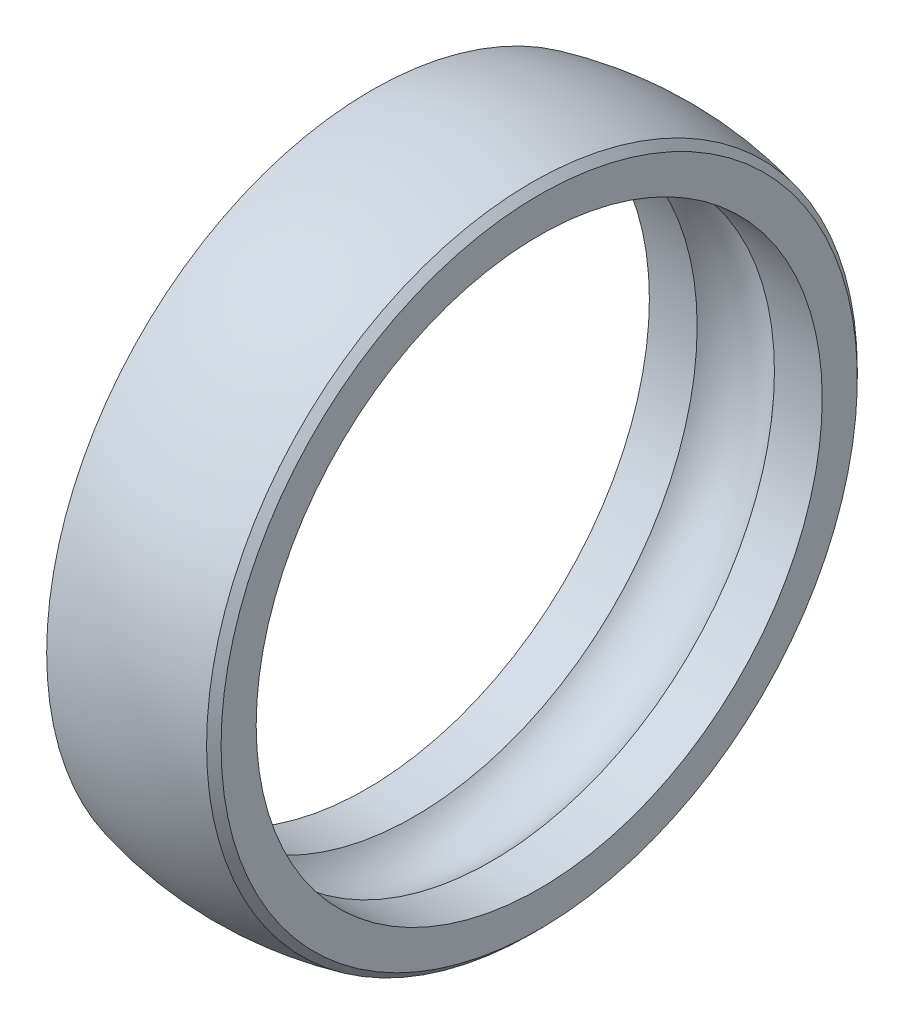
ISO-10303-21;
HEADER;
FILE_DESCRIPTION(('STEP AP214'),'2;1');
FILE_NAME('part.step','',(''),(''),'','','');
FILE_SCHEMA(('AUTOMOTIVE_DESIGN { 1 0 10303 214 1 1 1 1 }'));
ENDSEC;
DATA;
#1=APPLICATION_CONTEXT('core data for automotive mechanical design processes');
#2=APPLICATION_PROTOCOL_DEFINITION('international standard','automotive_design',2000,#1);
#3=PRODUCT_CONTEXT('',#1,'mechanical');
#4=PRODUCT('Part','Part','',(#3));
#5=PRODUCT_RELATED_PRODUCT_CATEGORY('part','',(#4));
#6=PRODUCT_DEFINITION_FORMATION('','',#4);
#7=PRODUCT_DEFINITION_CONTEXT('part definition',#1,'design');
#8=PRODUCT_DEFINITION('design','',#6,#7);
#9=PRODUCT_DEFINITION_SHAPE('','',#8);
#10=(LENGTH_UNIT() NAMED_UNIT(*) SI_UNIT(.MILLI.,.METRE.));
#11=(NAMED_UNIT(*) PLANE_ANGLE_UNIT() SI_UNIT($,.RADIAN.));
#12=(NAMED_UNIT(*) SI_UNIT($,.STERADIAN.) SOLID_ANGLE_UNIT());
#13=UNCERTAINTY_MEASURE_WITH_UNIT(LENGTH_MEASURE(1.E-05),#10,'distance_accuracy_value','');
#14=(GEOMETRIC_REPRESENTATION_CONTEXT(3) GLOBAL_UNCERTAINTY_ASSIGNED_CONTEXT((#13)) GLOBAL_UNIT_ASSIGNED_CONTEXT((#10,
#11,#12)) REPRESENTATION_CONTEXT('',''));
#15=CARTESIAN_POINT('',(0.,0.,0.));
#16=DIRECTION('',(0.,0.,1.));
#17=DIRECTION('',(1.,0.,0.));
#18=AXIS2_PLACEMENT_3D('',#15,#16,#17);
#19=CARTESIAN_POINT('',(0.,0.,-30.));
#20=DIRECTION('',(1.,0.,0.));
#21=DIRECTION('',(0.,0.,-1.));
#22=AXIS2_PLACEMENT_3D('',#19,#20,#21);
#23=PLANE('',#22);
#24=CARTESIAN_POINT('',(0.,0.,0.));
#25=DIRECTION('',(1.,0.,0.));
#26=DIRECTION('',(0.,0.,-1.));
#27=AXIS2_PLACEMENT_3D('',#24,#25,#26);
#28=CIRCLE('',#27,29.2438065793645);
#29=CARTESIAN_POINT('',(0.,0.,-29.2438065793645));
#30=VERTEX_POINT('',#29);
#31=EDGE_CURVE('E10',#30,#30,#28,.F.);
#32=ORIENTED_EDGE('',*,*,#31,.T.);
#33=EDGE_LOOP('',(#32));
#34=FACE_BOUND('',#33,.T.);
#35=CARTESIAN_POINT('',(0.,0.,0.));
#36=DIRECTION('',(-1.,0.,0.));
#37=DIRECTION('',(0.,0.,1.));
#38=AXIS2_PLACEMENT_3D('',#35,#36,#37);
#39=CIRCLE('',#38,26.2);
#40=CARTESIAN_POINT('',(0.,0.,26.2));
#41=VERTEX_POINT('',#40);
#42=EDGE_CURVE('E54',#41,#41,#39,.T.);
#43=ORIENTED_EDGE('',*,*,#42,.F.);
#44=EDGE_LOOP('',(#43));
#45=FACE_BOUND('',#44,.T.);
#46=ADVANCED_FACE('F32',(#34,#45),#23,.F.);
#47=CARTESIAN_POINT('',(16.,0.,-30.));
#48=DIRECTION('',(-1.,0.,0.));
#49=DIRECTION('',(0.,0.,1.));
#50=AXIS2_PLACEMENT_3D('',#47,#48,#49);
#51=PLANE('',#50);
#52=CARTESIAN_POINT('',(16.,0.,0.));
#53=DIRECTION('',(-1.,0.,0.));
#54=DIRECTION('',(0.,0.,1.));
#55=AXIS2_PLACEMENT_3D('',#52,#53,#54);
#56=CIRCLE('',#55,29.4499582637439);
#57=CARTESIAN_POINT('',(16.,0.,29.4499582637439));
#58=VERTEX_POINT('',#57);
#59=EDGE_CURVE('E38',#58,#58,#56,.F.);
#60=ORIENTED_EDGE('',*,*,#59,.T.);
#61=EDGE_LOOP('',(#60));
#62=FACE_BOUND('',#61,.T.);
#63=CARTESIAN_POINT('',(16.,0.,0.));
#64=DIRECTION('',(-1.,0.,0.));
#65=DIRECTION('',(0.,0.,1.));
#66=AXIS2_PLACEMENT_3D('',#63,#64,#65);
#67=CIRCLE('',#66,26.2);
#68=CARTESIAN_POINT('',(16.,0.,26.2));
#69=VERTEX_POINT('',#68);
#70=EDGE_CURVE('E63',#69,#69,#67,.T.);
#71=ORIENTED_EDGE('',*,*,#70,.T.);
#72=EDGE_LOOP('',(#71));
#73=FACE_BOUND('',#72,.T.);
#74=ADVANCED_FACE('F67',(#62,#73),#51,.F.);
#75=CARTESIAN_POINT('',(0.,0.,0.));
#76=DIRECTION('',(-1.,0.,0.));
#77=DIRECTION('',(0.,0.,1.));
#78=AXIS2_PLACEMENT_3D('',#75,#76,#77);
#79=CYLINDRICAL_SURFACE('',#78,26.2);
#80=CARTESIAN_POINT('',(4.42229123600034,0.,0.));
#81=DIRECTION('',(-1.,0.,0.));
#82=DIRECTION('',(0.,0.,1.));
#83=AXIS2_PLACEMENT_3D('',#80,#81,#82);
#84=CIRCLE('',#83,26.2);
#85=CARTESIAN_POINT('',(4.42229123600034,0.,26.2));
#86=VERTEX_POINT('',#85);
#87=EDGE_CURVE('E57',#86,#86,#84,.T.);
#88=ORIENTED_EDGE('',*,*,#87,.F.);
#89=EDGE_LOOP('',(#88));
#90=FACE_BOUND('',#89,.T.);
#91=ORIENTED_EDGE('',*,*,#42,.T.);
#92=EDGE_LOOP('',(#91));
#93=FACE_BOUND('',#92,.T.);
#94=ADVANCED_FACE('F79',(#90,#93),#79,.F.);
#95=CARTESIAN_POINT('',(8.,0.,0.));
#96=DIRECTION('',(-1.,0.,0.));
#97=DIRECTION('',(0.,0.,1.));
#98=AXIS2_PLACEMENT_3D('',#95,#96,#97);
#99=TOROIDAL_SURFACE('',#98,23.,4.8);
#100=CARTESIAN_POINT('',(11.5777087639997,0.,0.));
#101=DIRECTION('',(-1.,0.,0.));
#102=DIRECTION('',(0.,0.,1.));
#103=AXIS2_PLACEMENT_3D('',#100,#101,#102);
#104=CIRCLE('',#103,26.2);
#105=CARTESIAN_POINT('',(11.5777087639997,0.,26.2));
#106=VERTEX_POINT('',#105);
#107=EDGE_CURVE('E60',#106,#106,#104,.T.);
#108=ORIENTED_EDGE('',*,*,#107,.F.);
#109=EDGE_LOOP('',(#108));
#110=FACE_BOUND('',#109,.T.);
#111=ORIENTED_EDGE('',*,*,#87,.T.);
#112=EDGE_LOOP('',(#111));
#113=FACE_BOUND('',#112,.T.);
#114=ADVANCED_FACE('F73',(#110,#113),#99,.F.);
#115=CARTESIAN_POINT('',(0.,0.,0.));
#116=DIRECTION('',(-1.,0.,0.));
#117=DIRECTION('',(0.,0.,1.));
#118=AXIS2_PLACEMENT_3D('',#115,#116,#117);
#119=CYLINDRICAL_SURFACE('',#118,26.2);
#120=ORIENTED_EDGE('',*,*,#70,.F.);
#121=EDGE_LOOP('',(#120));
#122=FACE_BOUND('',#121,.T.);
#123=ORIENTED_EDGE('',*,*,#107,.T.);
#124=EDGE_LOOP('',(#123));
#125=FACE_BOUND('',#124,.T.);
#126=ADVANCED_FACE('F69',(#122,#125),#119,.F.);
#127=CARTESIAN_POINT('',(8.,0.,0.));
#128=DIRECTION('',(-1.,0.,0.));
#129=DIRECTION('',(0.,1.,0.));
#130=AXIS2_PLACEMENT_3D('',#127,#128,#129);
#131=SPHERICAL_SURFACE('',#130,31.);
#132=CARTESIAN_POINT('',(15.3287009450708,0.,0.));
#133=DIRECTION('',(-1.,0.,0.));
#134=DIRECTION('',(0.,0.,1.));
#135=AXIS2_PLACEMENT_3D('',#132,#133,#134);
#136=CIRCLE('',#135,30.1212573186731);
#137=CARTESIAN_POINT('',(15.3287009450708,30.1212573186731,0.));
#138=VERTEX_POINT('',#137);
#139=EDGE_CURVE('E43',#138,#138,#136,.T.);
#140=CARTESIAN_POINT('',(0.480253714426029,0.,0.));
#141=DIRECTION('',(1.,0.,0.));
#142=DIRECTION('',(0.,0.,-1.));
#143=AXIS2_PLACEMENT_3D('',#140,#141,#142);
#144=CIRCLE('',#143,30.0741320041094);
#145=CARTESIAN_POINT('',(0.48025371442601,30.0741320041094,0.));
#146=VERTEX_POINT('',#145);
#147=EDGE_CURVE('E49',#146,#146,#144,.T.);
#148=CARTESIAN_POINT('',(15.3287009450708,30.1212573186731,0.));
#149=CARTESIAN_POINT('',(15.1769382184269,30.1581822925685,0.));
#150=CARTESIAN_POINT('',(15.0248963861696,30.193960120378,0.));
#151=CARTESIAN_POINT('',(14.7202893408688,30.2632137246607,0.));
#152=CARTESIAN_POINT('',(14.5677241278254,30.2966895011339,0.));
#153=CARTESIAN_POINT('',(14.2621051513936,30.3613312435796,0.));
#154=CARTESIAN_POINT('',(14.1090513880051,30.3924972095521,0.));
#155=CARTESIAN_POINT('',(13.8024902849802,30.4525122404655,0.));
#156=CARTESIAN_POINT('',(13.6489829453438,30.4813613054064,0.));
#157=CARTESIAN_POINT('',(13.341549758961,30.5367359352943,0.));
#158=CARTESIAN_POINT('',(13.1876239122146,30.5632615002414,0.));
#159=CARTESIAN_POINT('',(12.8793888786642,30.6139830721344,0.));
#160=CARTESIAN_POINT('',(12.7250796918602,30.6381790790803,0.));
#161=CARTESIAN_POINT('',(12.4161132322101,30.6842360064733,0.));
#162=CARTESIAN_POINT('',(12.261455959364,30.7060969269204,0.));
#163=CARTESIAN_POINT('',(11.9518286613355,30.7474786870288,0.));
#164=CARTESIAN_POINT('',(11.7968586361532,30.7669995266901,0.));
#165=CARTESIAN_POINT('',(11.4866412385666,30.80369666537,0.));
#166=CARTESIAN_POINT('',(11.3313938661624,30.8208729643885,0.));
#167=CARTESIAN_POINT('',(11.0206572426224,30.8528770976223,0.));
#168=CARTESIAN_POINT('',(10.8651679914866,30.8677049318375,0.));
#169=CARTESIAN_POINT('',(10.5539831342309,30.8950087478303,0.));
#170=CARTESIAN_POINT('',(10.3982875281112,30.9074847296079,0.));
#171=CARTESIAN_POINT('',(10.0867255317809,30.9300819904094,0.));
#172=CARTESIAN_POINT('',(9.93085914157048,30.9402032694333,0.));
#173=CARTESIAN_POINT('',(9.61899118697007,30.9580888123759,0.));
#174=CARTESIAN_POINT('',(9.4629896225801,30.9658530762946,0.));
#175=CARTESIAN_POINT('',(9.15088696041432,30.9790228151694,0.));
#176=CARTESIAN_POINT('',(8.9947858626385,30.9844282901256,0.));
#177=CARTESIAN_POINT('',(8.68251979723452,30.9928792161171,0.));
#178=CARTESIAN_POINT('',(8.52635482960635,30.9959246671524,0.));
#179=CARTESIAN_POINT('',(8.21399670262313,30.9996548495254,0.));
#180=CARTESIAN_POINT('',(8.05780354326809,31.000339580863,0.));
#181=CARTESIAN_POINT('',(7.7454247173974,30.9993481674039,0.));
#182=CARTESIAN_POINT('',(7.58923905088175,30.9976720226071,0.));
#183=CARTESIAN_POINT('',(7.2769108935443,30.9919592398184,0.));
#184=CARTESIAN_POINT('',(7.12076840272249,30.9879226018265,0.));
#185=CARTESIAN_POINT('',(6.80856226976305,30.9774897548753,0.));
#186=CARTESIAN_POINT('',(6.65249862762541,30.9710935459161,0.));
#187=CARTESIAN_POINT('',(6.3404858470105,30.955943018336,0.));
#188=CARTESIAN_POINT('',(6.18453670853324,30.9471886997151,0.));
#189=CARTESIAN_POINT('',(5.87278856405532,30.9273239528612,0.));
#190=CARTESIAN_POINT('',(5.71698955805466,30.9162135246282,0.));
#191=CARTESIAN_POINT('',(5.4055772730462,30.8916390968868,0.));
#192=CARTESIAN_POINT('',(5.2499639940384,30.8781750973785,0.));
#193=CARTESIAN_POINT('',(4.93895871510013,30.8488966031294,0.));
#194=CARTESIAN_POINT('',(4.78356671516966,30.8330821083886,0.));
#195=CARTESIAN_POINT('',(4.47303949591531,30.7991062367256,0.));
#196=CARTESIAN_POINT('',(4.31790427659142,30.7809448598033,0.));
#197=CARTESIAN_POINT('',(4.00792606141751,30.7422793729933,0.));
#198=CARTESIAN_POINT('',(3.85308306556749,30.7217752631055,0.));
#199=CARTESIAN_POINT('',(3.54372467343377,30.6784289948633,0.));
#200=CARTESIAN_POINT('',(3.38920927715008,30.6555868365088,0.));
#201=CARTESIAN_POINT('',(3.08054138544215,30.6075696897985,0.));
#202=CARTESIAN_POINT('',(2.92638889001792,30.5823947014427,0.));
#203=CARTESIAN_POINT('',(2.61848201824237,30.5297176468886,0.));
#204=CARTESIAN_POINT('',(2.46472764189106,30.5022155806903,0.));
#205=CARTESIAN_POINT('',(2.15765213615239,30.4448906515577,0.));
#206=CARTESIAN_POINT('',(2.00433100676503,30.4150677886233,0.));
#207=CARTESIAN_POINT('',(1.69815702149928,30.353108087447,0.));
#208=CARTESIAN_POINT('',(1.54530416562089,30.3209712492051,0.));
#209=CARTESIAN_POINT('',(1.24010165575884,30.2543909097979,0.));
#210=CARTESIAN_POINT('',(1.08775200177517,30.2199474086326,0.));
#211=CARTESIAN_POINT('',(0.78359067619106,30.1487617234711,0.));
#212=CARTESIAN_POINT('',(0.63177900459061,30.1120195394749,0.));
#213=CARTESIAN_POINT('',(0.48025371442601,30.0741320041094,0.));
#214=B_SPLINE_CURVE_WITH_KNOTS('',3,(#148,#149,#150,#151,#152,#153,#154,#155,#156,#157,#158,
#159,#160,#161,#162,#163,#164,#165,#166,#167,#168,#169,#170,#171,#172,#173,#174,#175,#176,#177,
#178,#179,#180,#181,#182,#183,#184,#185,#186,#187,#188,#189,#190,#191,#192,#193,#194,#195,#196,
#197,#198,#199,#200,#201,#202,#203,#204,#205,#206,#207,#208,#209,#210,#211,#212,#213),
.UNSPECIFIED.,.F.,.F.,(4,2,2,2,2,2,2,2,2,2,2,2,2,2,2,2,2,2,2,2,2,2,2,2,2,2,2,2,2,2,2,2,4),(0.,
0.468566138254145,0.937132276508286,1.40569841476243,1.87426455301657,2.34283069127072,
2.81139682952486,3.279962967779,3.74852910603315,4.21709524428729,4.68566138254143,
5.15422752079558,5.62279365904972,6.09135979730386,6.55992593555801,7.02849207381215,
7.49705821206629,7.96562435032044,8.43419048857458,8.90275662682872,9.37132276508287,
9.83988890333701,10.3084550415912,10.7770211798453,11.2455873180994,11.7141534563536,
12.1827195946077,12.6512857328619,13.119851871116,13.5884180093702,14.0569841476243,
14.5255502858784,14.9941164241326),.UNSPECIFIED.);
#215=EDGE_CURVE('BSEAM72',#138,#146,#214,.T.);
#216=ORIENTED_EDGE('',*,*,#139,.T.);
#217=ORIENTED_EDGE('',*,*,#147,.T.);
#218=ORIENTED_EDGE('',*,*,#215,.T.);
#219=ORIENTED_EDGE('',*,*,#215,.F.);
#220=EDGE_LOOP('',(#216,#218,#217,#219));
#221=FACE_BOUND('',#220,.T.);
#222=ADVANCED_FACE('F72',(#221),#131,.T.);
#223=CARTESIAN_POINT('',(15.3287009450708,0.,0.));
#224=DIRECTION('',(-1.,0.,0.));
#225=DIRECTION('',(0.,0.,1.));
#226=AXIS2_PLACEMENT_3D('',#223,#224,#225);
#227=CONICAL_SURFACE('',#226,30.1212573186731,0.785398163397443);
#228=ORIENTED_EDGE('',*,*,#59,.F.);
#229=EDGE_LOOP('',(#228));
#230=FACE_BOUND('',#229,.T.);
#231=ORIENTED_EDGE('',*,*,#139,.F.);
#232=EDGE_LOOP('',(#231));
#233=FACE_BOUND('',#232,.T.);
#234=ADVANCED_FACE('F96',(#230,#233),#227,.T.);
#235=CARTESIAN_POINT('',(0.,0.,0.));
#236=DIRECTION('',(1.,0.,0.));
#237=DIRECTION('',(0.,0.,-1.));
#238=AXIS2_PLACEMENT_3D('',#235,#236,#237);
#239=CONICAL_SURFACE('',#238,29.2438065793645,1.04641648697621);
#240=ORIENTED_EDGE('',*,*,#147,.F.);
#241=EDGE_LOOP('',(#240));
#242=FACE_BOUND('',#241,.T.);
#243=ORIENTED_EDGE('',*,*,#31,.F.);
#244=EDGE_LOOP('',(#243));
#245=FACE_BOUND('',#244,.T.);
#246=ADVANCED_FACE('F100',(#242,#245),#239,.T.);
#247=CLOSED_SHELL('',(#46,#74,#94,#114,#126,#222,#234,#246));
#248=MANIFOLD_SOLID_BREP('B2',#247);
#249=ADVANCED_BREP_SHAPE_REPRESENTATION('',(#18,#248),#14);
#250=SHAPE_DEFINITION_REPRESENTATION(#9,#249);
ENDSEC;
END-ISO-10303-21;
